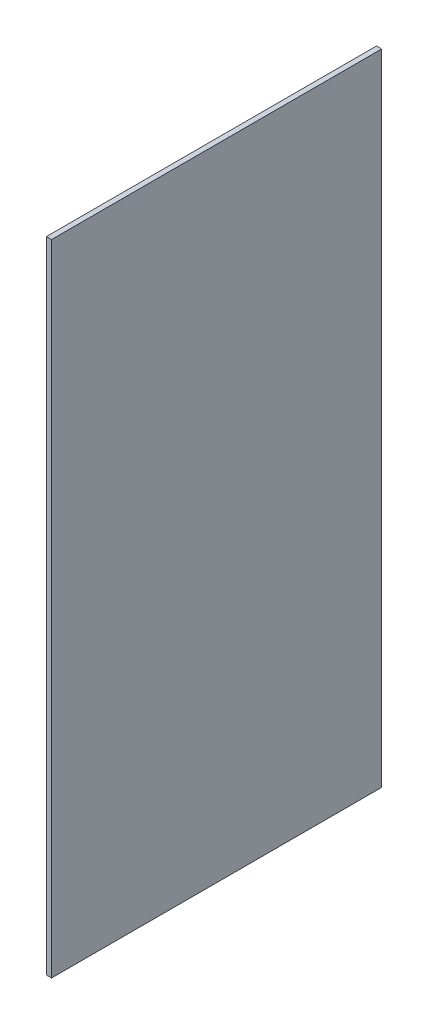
from build123d import *

# Parameters (mm, degrees)
SKETCH1_W           = 9.525
SKETCH1_H           = 609.6
BOSS_EXTRUDE1_DEPTH = 1181.1


with BuildPart() as part:
    # Sketch1 → Boss-Extrude1 (new body)
    with BuildSketch(Plane(origin=(0, 0, 0), x_dir=(-1, 0, 0), z_dir=(0, 1, 0))):
        Rectangle(SKETCH1_W, SKETCH1_H)
    extrude(amount=BOSS_EXTRUDE1_DEPTH)


solid = part.part
